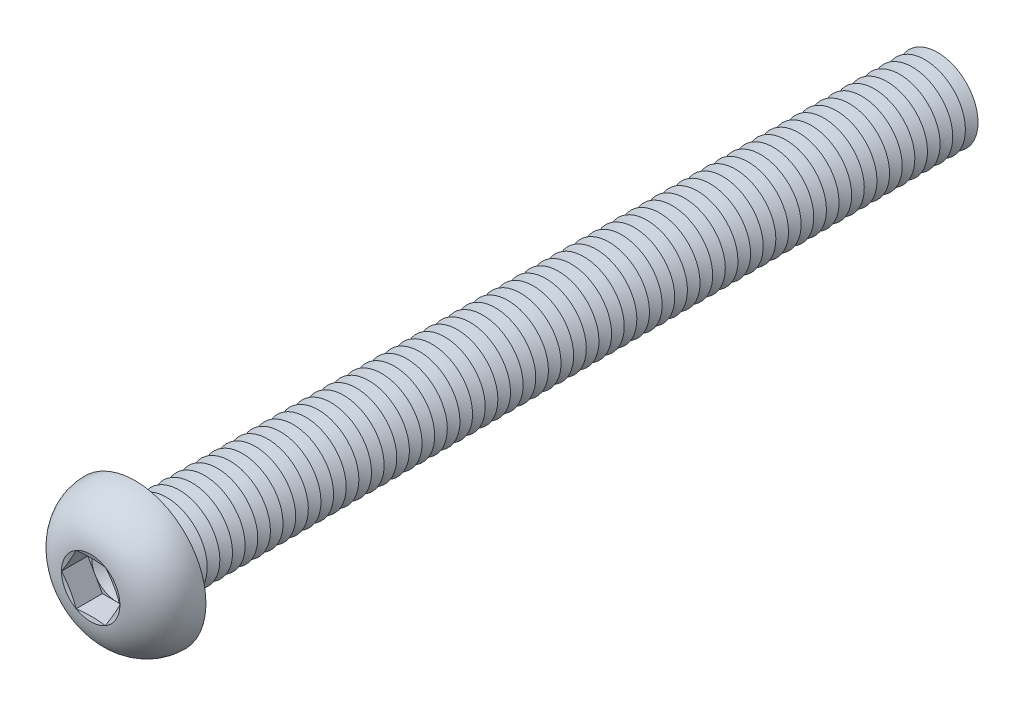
from build123d import *

# Parameters (mm, degrees)
FILLET1_R          = 0.625
LPATTERN1_COUNT    = 64
LPATTERN1_PITCH    = 1.25
CUT_EXTRUDE1_DEPTH = 2.6


with BuildPart() as part:
    # Sketch1 → Revolve1 (revolve)
    with BuildSketch(Plane(origin=(0, 0, 0), x_dir=(0, 0, -1), z_dir=(1, 0, 0))):
        with BuildLine():
            Line((0, 4), (0, 7))
            ThreePointArc((0, 7), (-3.011595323, 5.81154966), (-4.4, 2.88675))
            Line((-4.4, 2.88675), (-4.013248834, 1.443375))
            Line((-4.013248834, 1.443375), (-4.4, 1.443375))
            Line((-4.4, 1.443375), (-4.4, 0))
            Line((-4.4, 0), (80, 0))
            Line((80, 0), (80, 4))
            Line((80, 4), (0, 4))
        make_face()
    revolve(axis=Axis((0, 0, -80), (0, 0, 1)))

    # Fillet1
    fillet1_edges = [part.edges().sort_by_distance(p)[0] for p in [
        (0, -4, 0),
    ]]
    fillet(fillet1_edges, radius=FILLET1_R)

    # Sketch2 → Cut-Revolve1 (revolve, cut)
    with BuildSketch(Plane(origin=(0, 0, 0), x_dir=(0, 0, -1), z_dir=(1, 0, 0))):
        Polygon((79.375, 4), (80.625, 4), (80, 2.917468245), align=None)
    cut_revolve1 = revolve(axis=Axis((0, 0, -80), (0, 0, -1)), mode=Mode.SUBTRACT)

    # LPattern1: Cut-Revolve1 ×64
    with Locations(*[(0, 0, i * LPATTERN1_PITCH) for i in range(1, LPATTERN1_COUNT)]):
        add(cut_revolve1, mode=Mode.SUBTRACT)

    # Sketch3 → Cut-Extrude1 (cut)
    with BuildSketch(Plane.XY.offset(4.4)):
        Polygon((1.443375, 2.499998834), (-1.443375, 2.499998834), (-2.88675, 0), (-1.443375, -2.499998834), (1.443375, -2.499998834), (2.88675, 0), align=None)
    extrude(amount=-CUT_EXTRUDE1_DEPTH, mode=Mode.SUBTRACT)

    # Cut-Extrude2 cone 1 section (on through the dimple's axis) → Cut-Extrude2 (revolve, cut)
    with BuildSketch(Plane(origin=(0, 0, 1.8), x_dir=(0, -1, 0), z_dir=(1, 0, 0))):
        Polygon((0, 0), (2.499998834, 0), (0, 1.443375), align=None)
    revolve(axis=Axis((0, 0, 1.8), (0, 0, -1)), mode=Mode.SUBTRACT)


solid = part.part
